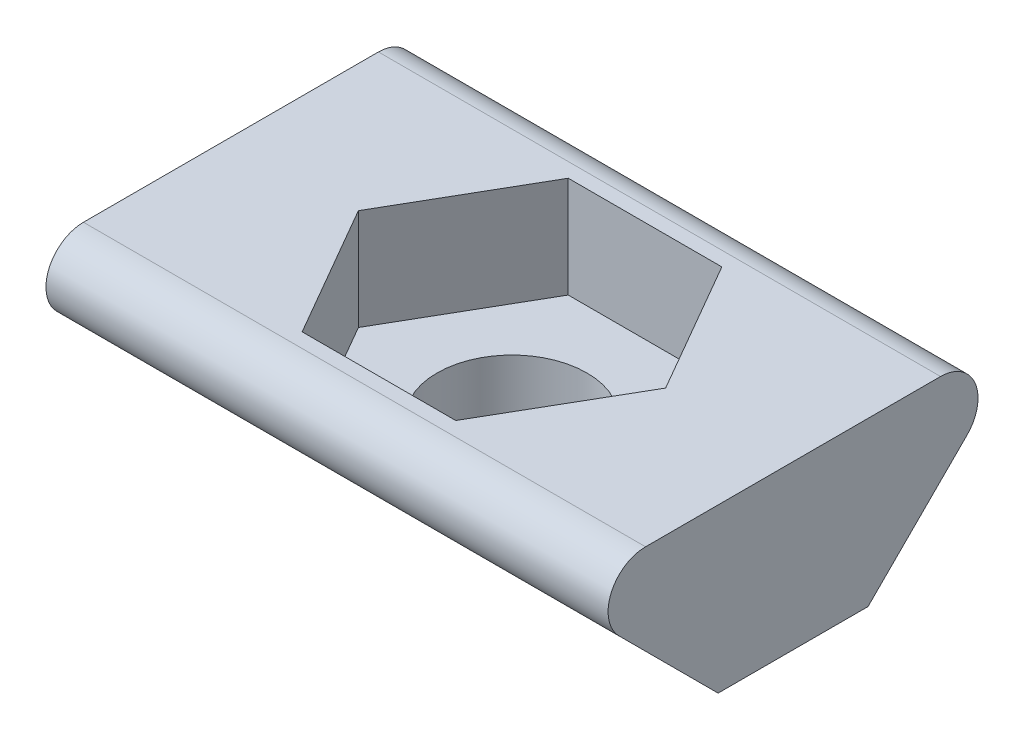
from build123d import *

# Parameters (mm, degrees)
BOSS_EXTRUDE1_DEPTH = 15
CUT_EXTRUDE1_DEPTH  = 2.7
SKETCH4_R           = 2
CUT_EXTRUDE2_DEPTH  = 15


with BuildPart() as part:
    # Sketch2 → Boss-Extrude1 (new body)
    with BuildSketch(Plane(origin=(0, 0, 0), x_dir=(0, 0, -1), z_dir=(1, 0, 0))):
        with BuildLine():
            Line((-3.935786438, 4.35), (3.935786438, 4.35))
            ThreePointArc((3.935786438, 4.35), (4.85966597, 3.732683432), (4.642893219, 2.642893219))
            Line((4.642893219, 2.642893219), (2, 0))
            Line((2, 0), (-2, 0))
            Line((-2, 0), (-4.642893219, 2.642893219))
            ThreePointArc((-4.642893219, 2.642893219), (-4.85966597, 3.732683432), (-3.935786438, 4.35))
        make_face()
    extrude(amount=BOSS_EXTRUDE1_DEPTH)

    # Sketch3 → Cut-Extrude1 (cut)
    with BuildSketch(Plane(origin=(0, 4.35, 0), x_dir=(1, 0, 0), z_dir=(0, 1, 0))):
        Polygon((11.599186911, 0), (9.549593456, 3.55), (5.450406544, 3.55), (3.400813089, 0), (5.450406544, -3.55), (9.549593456, -3.55), align=None)
    extrude(amount=-CUT_EXTRUDE1_DEPTH, mode=Mode.SUBTRACT)

    # Sketch4 → Cut-Extrude2 (cut)
    with BuildSketch(Plane(origin=(0, 1.65, 0), x_dir=(1, 0, 0), z_dir=(0, 1, 0))):
        with Locations(Location((7.5, 0, 0), (0, 0, 270))):
            Circle(SKETCH4_R)
    extrude(amount=-CUT_EXTRUDE2_DEPTH, mode=Mode.SUBTRACT)


solid = part.part
